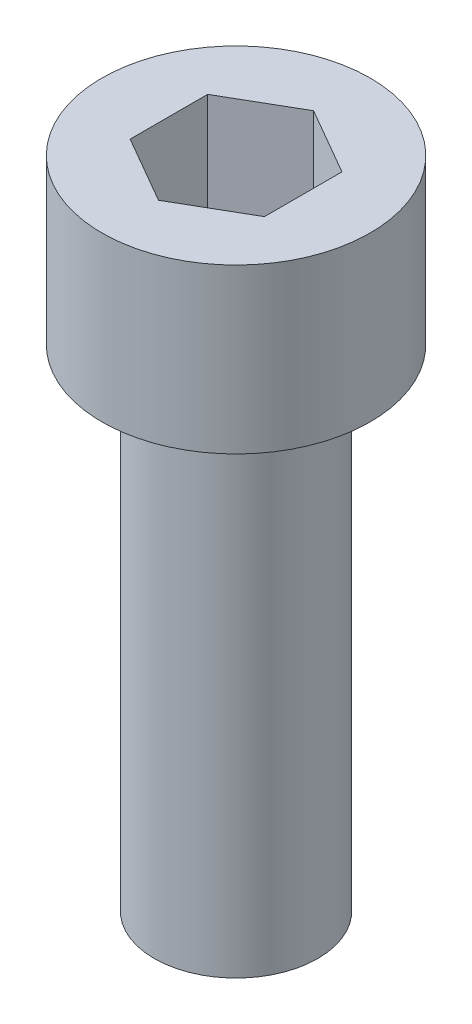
ISO-10303-21;
HEADER;
FILE_DESCRIPTION(('STEP AP214'),'2;1');
FILE_NAME('part.step','',(''),(''),'','','');
FILE_SCHEMA(('AUTOMOTIVE_DESIGN { 1 0 10303 214 1 1 1 1 }'));
ENDSEC;
DATA;
#1=APPLICATION_CONTEXT('core data for automotive mechanical design processes');
#2=APPLICATION_PROTOCOL_DEFINITION('international standard','automotive_design',2000,#1);
#3=PRODUCT_CONTEXT('',#1,'mechanical');
#4=PRODUCT('Part','Part','',(#3));
#5=PRODUCT_RELATED_PRODUCT_CATEGORY('part','',(#4));
#6=PRODUCT_DEFINITION_FORMATION('','',#4);
#7=PRODUCT_DEFINITION_CONTEXT('part definition',#1,'design');
#8=PRODUCT_DEFINITION('design','',#6,#7);
#9=PRODUCT_DEFINITION_SHAPE('','',#8);
#10=(LENGTH_UNIT() NAMED_UNIT(*) SI_UNIT(.MILLI.,.METRE.));
#11=(NAMED_UNIT(*) PLANE_ANGLE_UNIT() SI_UNIT($,.RADIAN.));
#12=(NAMED_UNIT(*) SI_UNIT($,.STERADIAN.) SOLID_ANGLE_UNIT());
#13=UNCERTAINTY_MEASURE_WITH_UNIT(LENGTH_MEASURE(1.E-05),#10,'distance_accuracy_value','');
#14=(GEOMETRIC_REPRESENTATION_CONTEXT(3) GLOBAL_UNCERTAINTY_ASSIGNED_CONTEXT((#13)) GLOBAL_UNIT_ASSIGNED_CONTEXT((#10,
#11,#12)) REPRESENTATION_CONTEXT('',''));
#15=CARTESIAN_POINT('',(0.,0.,0.));
#16=DIRECTION('',(0.,0.,1.));
#17=DIRECTION('',(1.,0.,0.));
#18=AXIS2_PLACEMENT_3D('',#15,#16,#17);
#19=CARTESIAN_POINT('',(-1.5875000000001,-12.7,0.));
#20=DIRECTION('',(0.,-1.,0.));
#21=DIRECTION('',(0.,0.,1.));
#22=AXIS2_PLACEMENT_3D('',#19,#20,#21);
#23=PLANE('',#22);
#24=CARTESIAN_POINT('',(0.,-12.7,0.));
#25=DIRECTION('',(0.,-1.,0.));
#26=DIRECTION('',(0.,0.,-1.));
#27=AXIS2_PLACEMENT_3D('',#24,#25,#26);
#28=CIRCLE('',#27,1.58749999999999);
#29=CARTESIAN_POINT('',(0.,-12.7,-1.58749999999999));
#30=VERTEX_POINT('',#29);
#31=EDGE_CURVE('E11',#30,#30,#28,.T.);
#32=ORIENTED_EDGE('',*,*,#31,.T.);
#33=EDGE_LOOP('',(#32));
#34=FACE_BOUND('',#33,.T.);
#35=ADVANCED_FACE('F36',(#34),#23,.T.);
#36=CARTESIAN_POINT('',(0.,66.04,0.));
#37=DIRECTION('',(0.,1.,0.));
#38=DIRECTION('',(0.,0.,-1.));
#39=AXIS2_PLACEMENT_3D('',#36,#37,#38);
#40=CYLINDRICAL_SURFACE('',#39,1.58749999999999);
#41=ORIENTED_EDGE('',*,*,#31,.F.);
#42=EDGE_LOOP('',(#41));
#43=FACE_BOUND('',#42,.T.);
#44=CARTESIAN_POINT('',(0.,-3.175,0.));
#45=DIRECTION('',(0.,-1.,0.));
#46=DIRECTION('',(0.,0.,-1.));
#47=AXIS2_PLACEMENT_3D('',#44,#45,#46);
#48=CIRCLE('',#47,1.58749999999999);
#49=CARTESIAN_POINT('',(0.,-3.175,-1.58749999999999));
#50=VERTEX_POINT('',#49);
#51=EDGE_CURVE('E43',#50,#50,#48,.T.);
#52=ORIENTED_EDGE('',*,*,#51,.T.);
#53=EDGE_LOOP('',(#52));
#54=FACE_BOUND('',#53,.T.);
#55=ADVANCED_FACE('F149',(#43,#54),#40,.T.);
#56=CARTESIAN_POINT('',(-2.60350000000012,-3.175,0.));
#57=DIRECTION('',(0.,-1.,0.));
#58=DIRECTION('',(0.,0.,1.));
#59=AXIS2_PLACEMENT_3D('',#56,#57,#58);
#60=PLANE('',#59);
#61=ORIENTED_EDGE('',*,*,#51,.F.);
#62=EDGE_LOOP('',(#61));
#63=FACE_BOUND('',#62,.T.);
#64=CARTESIAN_POINT('',(0.,-3.175,0.));
#65=DIRECTION('',(0.,-1.,0.));
#66=DIRECTION('',(0.,0.,-1.));
#67=AXIS2_PLACEMENT_3D('',#64,#65,#66);
#68=CIRCLE('',#67,2.60349999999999);
#69=CARTESIAN_POINT('',(0.,-3.175,-2.6035));
#70=VERTEX_POINT('',#69);
#71=EDGE_CURVE('E144',#70,#70,#68,.T.);
#72=ORIENTED_EDGE('',*,*,#71,.T.);
#73=EDGE_LOOP('',(#72));
#74=FACE_BOUND('',#73,.T.);
#75=ADVANCED_FACE('F151',(#63,#74),#60,.T.);
#76=CARTESIAN_POINT('',(0.,66.04,0.));
#77=DIRECTION('',(0.,1.,0.));
#78=DIRECTION('',(0.,0.,-1.));
#79=AXIS2_PLACEMENT_3D('',#76,#77,#78);
#80=CYLINDRICAL_SURFACE('',#79,2.60349999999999);
#81=ORIENTED_EDGE('',*,*,#71,.F.);
#82=EDGE_LOOP('',(#81));
#83=FACE_BOUND('',#82,.T.);
#84=CARTESIAN_POINT('',(0.,0.,0.));
#85=DIRECTION('',(0.,-1.,0.));
#86=DIRECTION('',(0.,0.,-1.));
#87=AXIS2_PLACEMENT_3D('',#84,#85,#86);
#88=CIRCLE('',#87,2.60349999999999);
#89=CARTESIAN_POINT('',(0.,0.,-2.6035));
#90=VERTEX_POINT('',#89);
#91=EDGE_CURVE('E135',#90,#90,#88,.T.);
#92=ORIENTED_EDGE('',*,*,#91,.T.);
#93=EDGE_LOOP('',(#92));
#94=FACE_BOUND('',#93,.T.);
#95=ADVANCED_FACE('F154',(#83,#94),#80,.T.);
#96=CARTESIAN_POINT('',(0.,0.,0.));
#97=DIRECTION('',(0.,1.,0.));
#98=DIRECTION('',(0.,0.,-1.));
#99=AXIS2_PLACEMENT_3D('',#96,#97,#98);
#100=PLANE('',#99);
#101=DIRECTION('',(-0.866025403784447,0.,0.500000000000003));
#102=VECTOR('',#101,1.);
#103=CARTESIAN_POINT('',(1.3028921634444,0.,0.752225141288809));
#104=LINE('',#103,#102);
#105=CARTESIAN_POINT('',(1.3028921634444,0.,0.752225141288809));
#106=VERTEX_POINT('',#105);
#107=CARTESIAN_POINT('',(0.,0.,1.50445028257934));
#108=VERTEX_POINT('',#107);
#109=EDGE_CURVE('E113',#106,#108,#104,.T.);
#110=ORIENTED_EDGE('',*,*,#109,.T.);
#111=DIRECTION('',(-0.866025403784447,0.,-0.500000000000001));
#112=VECTOR('',#111,1.);
#113=CARTESIAN_POINT('',(0.,0.,1.50445028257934));
#114=LINE('',#113,#112);
#115=CARTESIAN_POINT('',(-1.30289216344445,0.,0.752225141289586));
#116=VERTEX_POINT('',#115);
#117=EDGE_CURVE('E94',#108,#116,#114,.T.);
#118=ORIENTED_EDGE('',*,*,#117,.T.);
#119=DIRECTION('',(0.,0.,-1.));
#120=VECTOR('',#119,1.);
#121=CARTESIAN_POINT('',(-1.30289216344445,0.,0.752225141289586));
#122=LINE('',#121,#120);
#123=CARTESIAN_POINT('',(-1.30289216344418,0.,-0.752225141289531));
#124=VERTEX_POINT('',#123);
#125=EDGE_CURVE('E102',#116,#124,#122,.T.);
#126=ORIENTED_EDGE('',*,*,#125,.T.);
#127=DIRECTION('',(0.866025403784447,0.,-0.500000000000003));
#128=VECTOR('',#127,1.);
#129=CARTESIAN_POINT('',(-1.30289216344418,0.,-0.752225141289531));
#130=LINE('',#129,#128);
#131=CARTESIAN_POINT('',(1.94289029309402E-13,0.,-1.50445028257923));
#132=VERTEX_POINT('',#131);
#133=EDGE_CURVE('E108',#124,#132,#130,.T.);
#134=ORIENTED_EDGE('',*,*,#133,.T.);
#135=DIRECTION('',(0.866025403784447,0.,0.500000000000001));
#136=VECTOR('',#135,1.);
#137=CARTESIAN_POINT('',(1.94289029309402E-13,0.,-1.50445028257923));
#138=LINE('',#137,#136);
#139=CARTESIAN_POINT('',(1.3028921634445,0.,-0.752225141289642));
#140=VERTEX_POINT('',#139);
#141=EDGE_CURVE('E118',#132,#140,#138,.T.);
#142=ORIENTED_EDGE('',*,*,#141,.T.);
#143=DIRECTION('',(0.,0.,1.));
#144=VECTOR('',#143,1.);
#145=CARTESIAN_POINT('',(1.3028921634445,0.,-0.752225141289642));
#146=LINE('',#145,#144);
#147=EDGE_CURVE('E121',#140,#106,#146,.T.);
#148=ORIENTED_EDGE('',*,*,#147,.T.);
#149=EDGE_LOOP('',(#110,#118,#126,#134,#142,#148));
#150=FACE_BOUND('',#149,.T.);
#151=ORIENTED_EDGE('',*,*,#91,.F.);
#152=EDGE_LOOP('',(#151));
#153=FACE_BOUND('',#152,.T.);
#154=ADVANCED_FACE('F110',(#150,#153),#100,.T.);
#155=CARTESIAN_POINT('',(1.3028921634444,-3.048,0.752225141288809));
#156=DIRECTION('',(0.500000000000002,0.,0.86602540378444));
#157=DIRECTION('',(-0.866025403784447,0.,0.500000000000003));
#158=AXIS2_PLACEMENT_3D('',#155,#156,#157);
#159=PLANE('',#158);
#160=ORIENTED_EDGE('',*,*,#109,.F.);
#161=DIRECTION('',(0.,1.,0.));
#162=VECTOR('',#161,1.);
#163=CARTESIAN_POINT('',(1.3028921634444,-3.048,0.752225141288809));
#164=LINE('',#163,#162);
#165=CARTESIAN_POINT('',(1.3028921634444,-3.048,0.752225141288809));
#166=VERTEX_POINT('',#165);
#167=EDGE_CURVE('E133',#166,#106,#164,.T.);
#168=ORIENTED_EDGE('',*,*,#167,.F.);
#169=DIRECTION('',(-0.866025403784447,0.,0.500000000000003));
#170=VECTOR('',#169,1.);
#171=CARTESIAN_POINT('',(1.3028921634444,-3.048,0.752225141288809));
#172=LINE('',#171,#170);
#173=CARTESIAN_POINT('',(0.,-3.048,1.50445028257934));
#174=VERTEX_POINT('',#173);
#175=EDGE_CURVE('E123',#166,#174,#172,.T.);
#176=ORIENTED_EDGE('',*,*,#175,.T.);
#177=DIRECTION('',(0.,1.,0.));
#178=VECTOR('',#177,1.);
#179=CARTESIAN_POINT('',(0.,-3.048,1.50445028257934));
#180=LINE('',#179,#178);
#181=EDGE_CURVE('E50',#174,#108,#180,.T.);
#182=ORIENTED_EDGE('',*,*,#181,.T.);
#183=EDGE_LOOP('',(#160,#168,#176,#182));
#184=FACE_BOUND('',#183,.T.);
#185=ADVANCED_FACE('F163',(#184),#159,.F.);
#186=CARTESIAN_POINT('',(1.3028921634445,-3.048,-0.752225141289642));
#187=DIRECTION('',(1.00000000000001,0.,0.));
#188=DIRECTION('',(0.,0.,1.));
#189=AXIS2_PLACEMENT_3D('',#186,#187,#188);
#190=PLANE('',#189);
#191=ORIENTED_EDGE('',*,*,#147,.F.);
#192=DIRECTION('',(0.,1.,0.));
#193=VECTOR('',#192,1.);
#194=CARTESIAN_POINT('',(1.3028921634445,-3.048,-0.752225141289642));
#195=LINE('',#194,#193);
#196=CARTESIAN_POINT('',(1.3028921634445,-3.048,-0.752225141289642));
#197=VERTEX_POINT('',#196);
#198=EDGE_CURVE('E136',#197,#140,#195,.T.);
#199=ORIENTED_EDGE('',*,*,#198,.F.);
#200=DIRECTION('',(0.,0.,1.));
#201=VECTOR('',#200,1.);
#202=CARTESIAN_POINT('',(1.3028921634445,-3.048,-0.752225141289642));
#203=LINE('',#202,#201);
#204=EDGE_CURVE('E58',#197,#166,#203,.T.);
#205=ORIENTED_EDGE('',*,*,#204,.T.);
#206=ORIENTED_EDGE('',*,*,#167,.T.);
#207=EDGE_LOOP('',(#191,#199,#205,#206));
#208=FACE_BOUND('',#207,.T.);
#209=ADVANCED_FACE('F168',(#208),#190,.F.);
#210=CARTESIAN_POINT('',(1.94289029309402E-13,-3.048,-1.50445028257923));
#211=DIRECTION('',(0.500000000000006,0.,-0.866025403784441));
#212=DIRECTION('',(0.866025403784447,0.,0.500000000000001));
#213=AXIS2_PLACEMENT_3D('',#210,#211,#212);
#214=PLANE('',#213);
#215=ORIENTED_EDGE('',*,*,#141,.F.);
#216=DIRECTION('',(0.,1.,0.));
#217=VECTOR('',#216,1.);
#218=CARTESIAN_POINT('',(1.94289029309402E-13,-3.048,-1.50445028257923));
#219=LINE('',#218,#217);
#220=CARTESIAN_POINT('',(1.94289029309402E-13,-3.048,-1.50445028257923));
#221=VERTEX_POINT('',#220);
#222=EDGE_CURVE('E138',#221,#132,#219,.T.);
#223=ORIENTED_EDGE('',*,*,#222,.F.);
#224=DIRECTION('',(0.866025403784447,0.,0.500000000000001));
#225=VECTOR('',#224,1.);
#226=CARTESIAN_POINT('',(1.94289029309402E-13,-3.048,-1.50445028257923));
#227=LINE('',#226,#225);
#228=EDGE_CURVE('E130',#221,#197,#227,.T.);
#229=ORIENTED_EDGE('',*,*,#228,.T.);
#230=ORIENTED_EDGE('',*,*,#198,.T.);
#231=EDGE_LOOP('',(#215,#223,#229,#230));
#232=FACE_BOUND('',#231,.T.);
#233=ADVANCED_FACE('F206',(#232),#214,.F.);
#234=CARTESIAN_POINT('',(-1.30289216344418,-3.048,-0.752225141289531));
#235=DIRECTION('',(-0.500000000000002,0.,-0.86602540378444));
#236=DIRECTION('',(0.866025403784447,0.,-0.500000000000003));
#237=AXIS2_PLACEMENT_3D('',#234,#235,#236);
#238=PLANE('',#237);
#239=ORIENTED_EDGE('',*,*,#133,.F.);
#240=DIRECTION('',(0.,1.,0.));
#241=VECTOR('',#240,1.);
#242=CARTESIAN_POINT('',(-1.30289216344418,-3.048,-0.752225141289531));
#243=LINE('',#242,#241);
#244=CARTESIAN_POINT('',(-1.30289216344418,-3.048,-0.752225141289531));
#245=VERTEX_POINT('',#244);
#246=EDGE_CURVE('E99',#245,#124,#243,.T.);
#247=ORIENTED_EDGE('',*,*,#246,.F.);
#248=DIRECTION('',(0.866025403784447,0.,-0.500000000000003));
#249=VECTOR('',#248,1.);
#250=CARTESIAN_POINT('',(-1.30289216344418,-3.048,-0.752225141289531));
#251=LINE('',#250,#249);
#252=EDGE_CURVE('E128',#245,#221,#251,.T.);
#253=ORIENTED_EDGE('',*,*,#252,.T.);
#254=ORIENTED_EDGE('',*,*,#222,.T.);
#255=EDGE_LOOP('',(#239,#247,#253,#254));
#256=FACE_BOUND('',#255,.T.);
#257=ADVANCED_FACE('F215',(#256),#238,.F.);
#258=CARTESIAN_POINT('',(-1.30289216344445,-3.048,0.752225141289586));
#259=DIRECTION('',(-1.00000000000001,0.,0.));
#260=DIRECTION('',(0.,0.,-1.));
#261=AXIS2_PLACEMENT_3D('',#258,#259,#260);
#262=PLANE('',#261);
#263=ORIENTED_EDGE('',*,*,#125,.F.);
#264=DIRECTION('',(0.,1.,0.));
#265=VECTOR('',#264,1.);
#266=CARTESIAN_POINT('',(-1.30289216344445,-3.048,0.752225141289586));
#267=LINE('',#266,#265);
#268=CARTESIAN_POINT('',(-1.30289216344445,-3.048,0.752225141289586));
#269=VERTEX_POINT('',#268);
#270=EDGE_CURVE('E90',#269,#116,#267,.T.);
#271=ORIENTED_EDGE('',*,*,#270,.F.);
#272=DIRECTION('',(0.,0.,-1.));
#273=VECTOR('',#272,1.);
#274=CARTESIAN_POINT('',(-1.30289216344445,-3.048,0.752225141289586));
#275=LINE('',#274,#273);
#276=EDGE_CURVE('E126',#269,#245,#275,.T.);
#277=ORIENTED_EDGE('',*,*,#276,.T.);
#278=ORIENTED_EDGE('',*,*,#246,.T.);
#279=EDGE_LOOP('',(#263,#271,#277,#278));
#280=FACE_BOUND('',#279,.T.);
#281=ADVANCED_FACE('F103',(#280),#262,.F.);
#282=CARTESIAN_POINT('',(0.,-3.048,1.50445028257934));
#283=DIRECTION('',(-0.500000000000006,0.,0.866025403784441));
#284=DIRECTION('',(-0.866025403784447,0.,-0.500000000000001));
#285=AXIS2_PLACEMENT_3D('',#282,#283,#284);
#286=PLANE('',#285);
#287=ORIENTED_EDGE('',*,*,#117,.F.);
#288=ORIENTED_EDGE('',*,*,#181,.F.);
#289=DIRECTION('',(-0.866025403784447,0.,-0.500000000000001));
#290=VECTOR('',#289,1.);
#291=CARTESIAN_POINT('',(0.,-3.048,1.50445028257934));
#292=LINE('',#291,#290);
#293=EDGE_CURVE('E96',#174,#269,#292,.T.);
#294=ORIENTED_EDGE('',*,*,#293,.T.);
#295=ORIENTED_EDGE('',*,*,#270,.T.);
#296=EDGE_LOOP('',(#287,#288,#294,#295));
#297=FACE_BOUND('',#296,.T.);
#298=ADVANCED_FACE('F92',(#297),#286,.F.);
#299=CARTESIAN_POINT('',(2.60578432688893,-3.048,2.77555756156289E-13));
#300=DIRECTION('',(0.,-1.,0.));
#301=DIRECTION('',(0.,0.,1.));
#302=AXIS2_PLACEMENT_3D('',#299,#300,#301);
#303=PLANE('',#302);
#304=ORIENTED_EDGE('',*,*,#175,.F.);
#305=ORIENTED_EDGE('',*,*,#204,.F.);
#306=ORIENTED_EDGE('',*,*,#228,.F.);
#307=ORIENTED_EDGE('',*,*,#252,.F.);
#308=ORIENTED_EDGE('',*,*,#276,.F.);
#309=ORIENTED_EDGE('',*,*,#293,.F.);
#310=EDGE_LOOP('',(#304,#305,#306,#307,#308,#309));
#311=FACE_BOUND('',#310,.T.);
#312=ADVANCED_FACE('F242',(#311),#303,.F.);
#313=CLOSED_SHELL('',(#35,#55,#75,#95,#154,#185,#209,#233,#257,#281,#298,#312));
#314=MANIFOLD_SOLID_BREP('B2',#313);
#315=ADVANCED_BREP_SHAPE_REPRESENTATION('',(#18,#314),#14);
#316=SHAPE_DEFINITION_REPRESENTATION(#9,#315);
ENDSEC;
END-ISO-10303-21;
